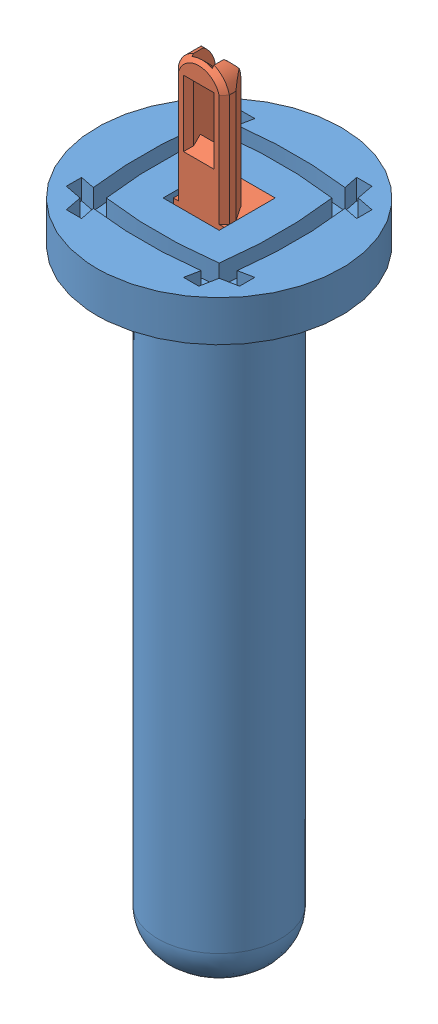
SolidWorks assembly Assem1.sldasm, configuration Default (file format 8000). Lengths in mm.
Overall size (48 153.65 48).
2 component instances, 2 part files, 2 mates.
Components (placement in the parent):
- cylinder-1: cylinder.SLDPRT [Default] at (55.5909 106.9459 66.8524) size (48 128 48)
- connector_falcon-1: connector_falcon.SLDPRT [Default] at (61.0909 136.9459 71.3524) x (0 -1 0) z (1 0 0) size (30.65 10 10)
Mates (geometry in assembly coordinates):
- Coincident1: coincident: line of cylinder-1 through (61.0909 114.9459 61.3524) axis (-1 0 0); line of connector_falcon-1 through (51.0909 114.9459 61.3524) axis (1 0 0)
- Coincident2: coincident anti-aligned: line of cylinder-1 through (61.0909 114.9459 72.3524) axis (0 0 -1); line of connector_falcon-1 through (61.0909 114.9459 61.3524) axis (0 0 1)
